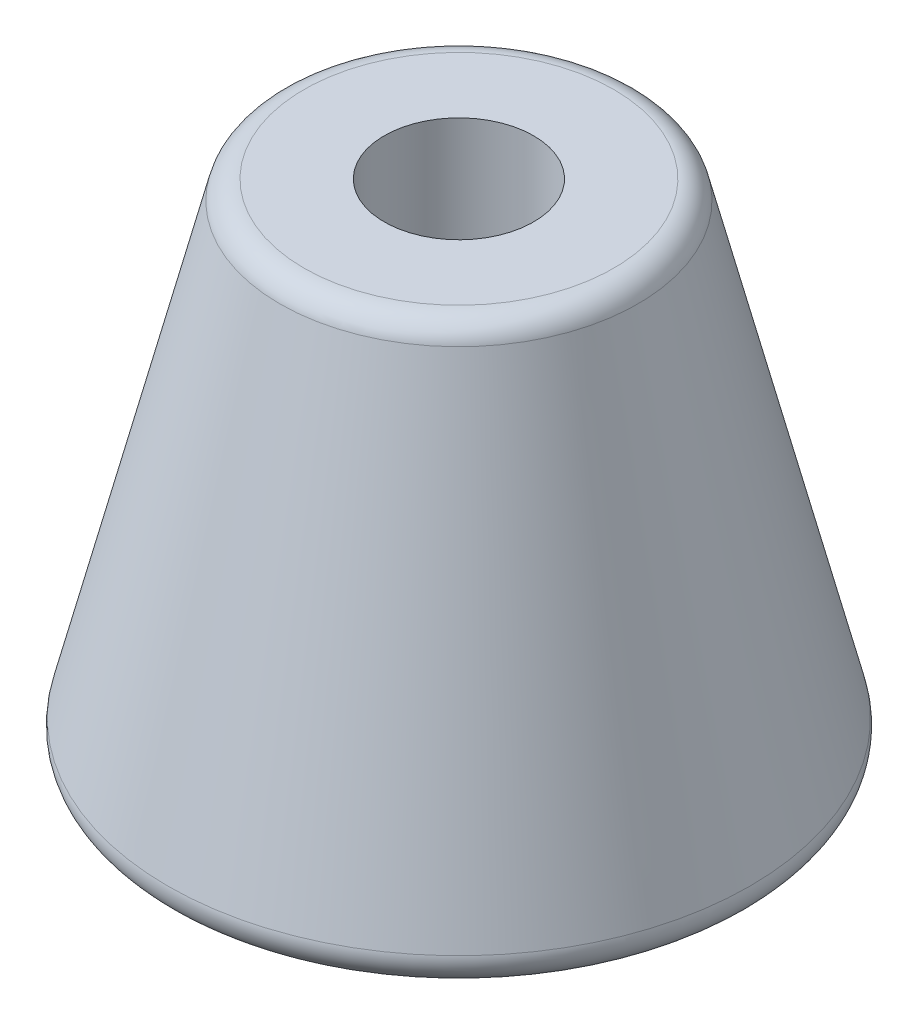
from build123d import *


with BuildPart() as part:
    # Schizzo1 → Rivoluzione1 (revolve)
    with BuildSketch(Plane.XY, mode=Mode.PRIVATE) as rivoluzione1_sk:
        with BuildLine():
            Line((4, 0), (10.719223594, 0))
            ThreePointArc((10.719223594, 0), (11.507429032, 0.384587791), (11.689366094, 1.242535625))
            Line((11.689366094, 1.242535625), (7.189366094, 19.242535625))
            ThreePointArc((7.189366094, 19.242535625), (6.834635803, 19.788205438), (6.219223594, 20))
            Line((6.219223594, 20), (3, 20))
            Line((3, 20), (3, 1))
            Line((3, 1), (4, 0))
        make_face()
    revolve(rivoluzione1_sk.sketch.rotate(Axis((0, 0, 0), (0, 1, 0)), 90), axis=Axis((0, 0, 0), (0, 1, 0)))


solid = part.part
